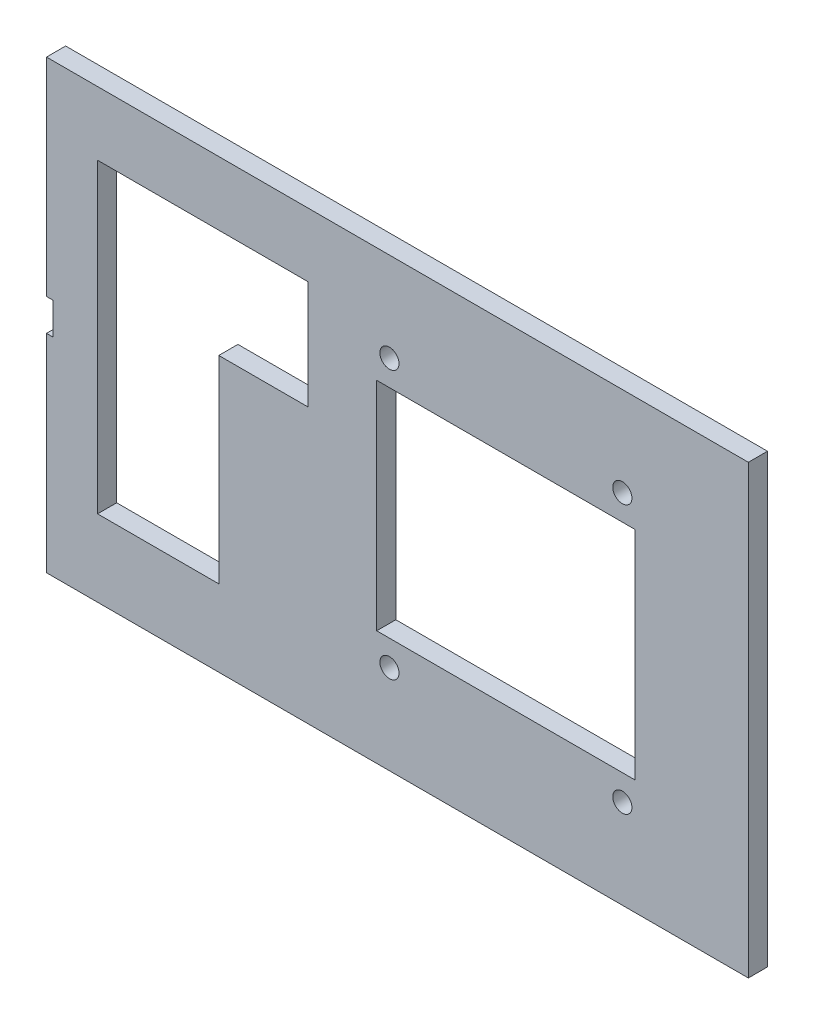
ISO-10303-21;
HEADER;
FILE_DESCRIPTION(('STEP AP214'),'2;1');
FILE_NAME('part.step','',(''),(''),'','','');
FILE_SCHEMA(('AUTOMOTIVE_DESIGN { 1 0 10303 214 1 1 1 1 }'));
ENDSEC;
DATA;
#1=APPLICATION_CONTEXT('core data for automotive mechanical design processes');
#2=APPLICATION_PROTOCOL_DEFINITION('international standard','automotive_design',2000,#1);
#3=PRODUCT_CONTEXT('',#1,'mechanical');
#4=PRODUCT('Part','Part','',(#3));
#5=PRODUCT_RELATED_PRODUCT_CATEGORY('part','',(#4));
#6=PRODUCT_DEFINITION_FORMATION('','',#4);
#7=PRODUCT_DEFINITION_CONTEXT('part definition',#1,'design');
#8=PRODUCT_DEFINITION('design','',#6,#7);
#9=PRODUCT_DEFINITION_SHAPE('','',#8);
#10=(LENGTH_UNIT() NAMED_UNIT(*) SI_UNIT(.MILLI.,.METRE.));
#11=(NAMED_UNIT(*) PLANE_ANGLE_UNIT() SI_UNIT($,.RADIAN.));
#12=(NAMED_UNIT(*) SI_UNIT($,.STERADIAN.) SOLID_ANGLE_UNIT());
#13=UNCERTAINTY_MEASURE_WITH_UNIT(LENGTH_MEASURE(1.E-05),#10,'distance_accuracy_value','');
#14=(GEOMETRIC_REPRESENTATION_CONTEXT(3) GLOBAL_UNCERTAINTY_ASSIGNED_CONTEXT((#13)) GLOBAL_UNIT_ASSIGNED_CONTEXT((#10,
#11,#12)) REPRESENTATION_CONTEXT('',''));
#15=CARTESIAN_POINT('',(0.,0.,0.));
#16=DIRECTION('',(0.,0.,1.));
#17=DIRECTION('',(1.,0.,0.));
#18=AXIS2_PLACEMENT_3D('',#15,#16,#17);
#19=CARTESIAN_POINT('',(0.,0.,3.));
#20=DIRECTION('',(0.,0.,1.));
#21=DIRECTION('',(1.,0.,0.));
#22=AXIS2_PLACEMENT_3D('',#19,#20,#21);
#23=PLANE('',#22);
#24=DIRECTION('',(0.,-1.,0.));
#25=VECTOR('',#24,1.);
#26=CARTESIAN_POINT('',(-47.,0.,3.));
#27=LINE('',#26,#25);
#28=CARTESIAN_POINT('',(-47.,25.,3.));
#29=VERTEX_POINT('',#28);
#30=CARTESIAN_POINT('',(-47.,-23.,3.));
#31=VERTEX_POINT('',#30);
#32=EDGE_CURVE('E187',#29,#31,#27,.T.);
#33=ORIENTED_EDGE('',*,*,#32,.F.);
#34=DIRECTION('',(-1.,0.,0.));
#35=VECTOR('',#34,1.);
#36=CARTESIAN_POINT('',(0.,25.,3.));
#37=LINE('',#36,#35);
#38=CARTESIAN_POINT('',(-14.,25.,3.));
#39=VERTEX_POINT('',#38);
#40=EDGE_CURVE('E185',#39,#29,#37,.T.);
#41=ORIENTED_EDGE('',*,*,#40,.F.);
#42=DIRECTION('',(0.,-1.,0.));
#43=VECTOR('',#42,1.);
#44=CARTESIAN_POINT('',(-14.,0.,3.));
#45=LINE('',#44,#43);
#46=CARTESIAN_POINT('',(-14.,7.99999999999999,3.));
#47=VERTEX_POINT('',#46);
#48=EDGE_CURVE('E180',#39,#47,#45,.T.);
#49=ORIENTED_EDGE('',*,*,#48,.T.);
#50=DIRECTION('',(-1.,0.,0.));
#51=VECTOR('',#50,1.);
#52=CARTESIAN_POINT('',(0.,7.99999999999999,3.));
#53=LINE('',#52,#51);
#54=CARTESIAN_POINT('',(-28.,7.99999999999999,3.));
#55=VERTEX_POINT('',#54);
#56=EDGE_CURVE('E178',#47,#55,#53,.T.);
#57=ORIENTED_EDGE('',*,*,#56,.T.);
#58=DIRECTION('',(0.,-1.,0.));
#59=VECTOR('',#58,1.);
#60=CARTESIAN_POINT('',(-28.,0.,3.));
#61=LINE('',#60,#59);
#62=CARTESIAN_POINT('',(-28.,-23.,3.));
#63=VERTEX_POINT('',#62);
#64=EDGE_CURVE('E163',#55,#63,#61,.T.);
#65=ORIENTED_EDGE('',*,*,#64,.T.);
#66=DIRECTION('',(-1.,0.,0.));
#67=VECTOR('',#66,1.);
#68=CARTESIAN_POINT('',(0.,-23.,3.));
#69=LINE('',#68,#67);
#70=EDGE_CURVE('E158',#63,#31,#69,.T.);
#71=ORIENTED_EDGE('',*,*,#70,.T.);
#72=EDGE_LOOP('',(#33,#41,#49,#57,#65,#71));
#73=FACE_BOUND('',#72,.T.);
#74=CARTESIAN_POINT('',(-1.25000000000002,21.,3.));
#75=DIRECTION('',(0.,0.,1.));
#76=DIRECTION('',(1.,0.,0.));
#77=AXIS2_PLACEMENT_3D('',#74,#75,#76);
#78=CIRCLE('',#77,1.5);
#79=CARTESIAN_POINT('',(0.249999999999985,21.,3.));
#80=VERTEX_POINT('',#79);
#81=EDGE_CURVE('E198',#80,#80,#78,.F.);
#82=ORIENTED_EDGE('',*,*,#81,.T.);
#83=EDGE_LOOP('',(#82));
#84=FACE_BOUND('',#83,.T.);
#85=CARTESIAN_POINT('',(35.25,-21.,3.));
#86=DIRECTION('',(0.,0.,1.));
#87=DIRECTION('',(1.,0.,0.));
#88=AXIS2_PLACEMENT_3D('',#85,#86,#87);
#89=CIRCLE('',#88,1.5);
#90=CARTESIAN_POINT('',(36.75,-21.,3.));
#91=VERTEX_POINT('',#90);
#92=EDGE_CURVE('E194',#91,#91,#89,.F.);
#93=ORIENTED_EDGE('',*,*,#92,.T.);
#94=EDGE_LOOP('',(#93));
#95=FACE_BOUND('',#94,.T.);
#96=CARTESIAN_POINT('',(-1.25000000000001,-21.,3.));
#97=DIRECTION('',(0.,0.,1.));
#98=DIRECTION('',(1.,0.,0.));
#99=AXIS2_PLACEMENT_3D('',#96,#97,#98);
#100=CIRCLE('',#99,1.5);
#101=CARTESIAN_POINT('',(0.249999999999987,-21.,3.));
#102=VERTEX_POINT('',#101);
#103=EDGE_CURVE('E190',#102,#102,#100,.F.);
#104=ORIENTED_EDGE('',*,*,#103,.T.);
#105=EDGE_LOOP('',(#104));
#106=FACE_BOUND('',#105,.T.);
#107=CARTESIAN_POINT('',(35.25,21.,3.));
#108=DIRECTION('',(0.,0.,1.));
#109=DIRECTION('',(1.,0.,0.));
#110=AXIS2_PLACEMENT_3D('',#107,#108,#109);
#111=CIRCLE('',#110,1.5);
#112=CARTESIAN_POINT('',(36.75,21.,3.));
#113=VERTEX_POINT('',#112);
#114=EDGE_CURVE('E202',#113,#113,#111,.F.);
#115=ORIENTED_EDGE('',*,*,#114,.T.);
#116=EDGE_LOOP('',(#115));
#117=FACE_BOUND('',#116,.T.);
#118=DIRECTION('',(0.,-1.,0.));
#119=VECTOR('',#118,1.);
#120=CARTESIAN_POINT('',(-55.,35.,3.));
#121=LINE('',#120,#119);
#122=CARTESIAN_POINT('',(-55.,35.,3.));
#123=VERTEX_POINT('',#122);
#124=CARTESIAN_POINT('',(-55.,2.5,3.));
#125=VERTEX_POINT('',#124);
#126=EDGE_CURVE('E254',#123,#125,#121,.T.);
#127=ORIENTED_EDGE('',*,*,#126,.T.);
#128=DIRECTION('',(1.,0.,0.));
#129=VECTOR('',#128,1.);
#130=CARTESIAN_POINT('',(0.,2.5,3.));
#131=LINE('',#130,#129);
#132=CARTESIAN_POINT('',(-54.,2.5,3.));
#133=VERTEX_POINT('',#132);
#134=EDGE_CURVE('E240',#125,#133,#131,.T.);
#135=ORIENTED_EDGE('',*,*,#134,.T.);
#136=DIRECTION('',(0.,-1.,0.));
#137=VECTOR('',#136,1.);
#138=CARTESIAN_POINT('',(-54.,0.,3.));
#139=LINE('',#138,#137);
#140=CARTESIAN_POINT('',(-54.,-2.5,3.));
#141=VERTEX_POINT('',#140);
#142=EDGE_CURVE('E243',#133,#141,#139,.T.);
#143=ORIENTED_EDGE('',*,*,#142,.T.);
#144=DIRECTION('',(-1.,0.,0.));
#145=VECTOR('',#144,1.);
#146=CARTESIAN_POINT('',(0.,-2.5,3.));
#147=LINE('',#146,#145);
#148=CARTESIAN_POINT('',(-55.,-2.5,3.));
#149=VERTEX_POINT('',#148);
#150=EDGE_CURVE('E235',#141,#149,#147,.T.);
#151=ORIENTED_EDGE('',*,*,#150,.T.);
#152=CARTESIAN_POINT('',(-55.,-35.,3.));
#153=VERTEX_POINT('',#152);
#154=EDGE_CURVE('E253',#149,#153,#121,.T.);
#155=ORIENTED_EDGE('',*,*,#154,.T.);
#156=DIRECTION('',(1.,0.,0.));
#157=VECTOR('',#156,1.);
#158=CARTESIAN_POINT('',(-55.,-35.,3.));
#159=LINE('',#158,#157);
#160=CARTESIAN_POINT('',(55.,-35.,3.));
#161=VERTEX_POINT('',#160);
#162=EDGE_CURVE('E257',#153,#161,#159,.T.);
#163=ORIENTED_EDGE('',*,*,#162,.T.);
#164=DIRECTION('',(0.,1.,0.));
#165=VECTOR('',#164,1.);
#166=CARTESIAN_POINT('',(55.,35.,3.));
#167=LINE('',#166,#165);
#168=CARTESIAN_POINT('',(55.,35.,3.));
#169=VERTEX_POINT('',#168);
#170=EDGE_CURVE('E247',#161,#169,#167,.T.);
#171=ORIENTED_EDGE('',*,*,#170,.T.);
#172=DIRECTION('',(-1.,0.,0.));
#173=VECTOR('',#172,1.);
#174=CARTESIAN_POINT('',(-55.,35.,3.));
#175=LINE('',#174,#173);
#176=EDGE_CURVE('E250',#169,#123,#175,.T.);
#177=ORIENTED_EDGE('',*,*,#176,.T.);
#178=EDGE_LOOP('',(#127,#135,#143,#151,#155,#163,#171,#177));
#179=FACE_BOUND('',#178,.T.);
#180=DIRECTION('',(1.,0.,0.));
#181=VECTOR('',#180,1.);
#182=CARTESIAN_POINT('',(0.,17.,3.));
#183=LINE('',#182,#181);
#184=CARTESIAN_POINT('',(-3.25000000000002,17.,3.));
#185=VERTEX_POINT('',#184);
#186=CARTESIAN_POINT('',(37.25,17.,3.));
#187=VERTEX_POINT('',#186);
#188=EDGE_CURVE('E222',#185,#187,#183,.T.);
#189=ORIENTED_EDGE('',*,*,#188,.T.);
#190=DIRECTION('',(0.,-1.,0.));
#191=VECTOR('',#190,1.);
#192=CARTESIAN_POINT('',(37.25,0.,3.));
#193=LINE('',#192,#191);
#194=CARTESIAN_POINT('',(37.25,-17.,3.));
#195=VERTEX_POINT('',#194);
#196=EDGE_CURVE('E225',#187,#195,#193,.T.);
#197=ORIENTED_EDGE('',*,*,#196,.T.);
#198=DIRECTION('',(-1.,0.,0.));
#199=VECTOR('',#198,1.);
#200=CARTESIAN_POINT('',(0.,-17.,3.));
#201=LINE('',#200,#199);
#202=CARTESIAN_POINT('',(-3.25000000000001,-17.,3.));
#203=VERTEX_POINT('',#202);
#204=EDGE_CURVE('E216',#195,#203,#201,.T.);
#205=ORIENTED_EDGE('',*,*,#204,.T.);
#206=DIRECTION('',(0.,1.,0.));
#207=VECTOR('',#206,1.);
#208=CARTESIAN_POINT('',(-3.25000000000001,0.,3.));
#209=LINE('',#208,#207);
#210=EDGE_CURVE('E219',#203,#185,#209,.T.);
#211=ORIENTED_EDGE('',*,*,#210,.T.);
#212=EDGE_LOOP('',(#189,#197,#205,#211));
#213=FACE_BOUND('',#212,.T.);
#214=ADVANCED_FACE('F36',(#73,#84,#95,#106,#117,#179,#213),#23,.T.);
#215=CARTESIAN_POINT('',(0.,0.,0.));
#216=DIRECTION('',(0.,0.,1.));
#217=DIRECTION('',(1.,0.,0.));
#218=AXIS2_PLACEMENT_3D('',#215,#216,#217);
#219=PLANE('',#218);
#220=DIRECTION('',(-1.,0.,0.));
#221=VECTOR('',#220,1.);
#222=CARTESIAN_POINT('',(0.,25.,0.));
#223=LINE('',#222,#221);
#224=CARTESIAN_POINT('',(-14.,25.,0.));
#225=VERTEX_POINT('',#224);
#226=CARTESIAN_POINT('',(-47.,25.,0.));
#227=VERTEX_POINT('',#226);
#228=EDGE_CURVE('E44',#225,#227,#223,.T.);
#229=ORIENTED_EDGE('',*,*,#228,.T.);
#230=DIRECTION('',(0.,-1.,0.));
#231=VECTOR('',#230,1.);
#232=CARTESIAN_POINT('',(-47.,0.,0.));
#233=LINE('',#232,#231);
#234=CARTESIAN_POINT('',(-47.,-23.,0.));
#235=VERTEX_POINT('',#234);
#236=EDGE_CURVE('E11',#227,#235,#233,.T.);
#237=ORIENTED_EDGE('',*,*,#236,.T.);
#238=DIRECTION('',(-1.,0.,0.));
#239=VECTOR('',#238,1.);
#240=CARTESIAN_POINT('',(0.,-23.,0.));
#241=LINE('',#240,#239);
#242=CARTESIAN_POINT('',(-28.,-23.,0.));
#243=VERTEX_POINT('',#242);
#244=EDGE_CURVE('E296',#243,#235,#241,.T.);
#245=ORIENTED_EDGE('',*,*,#244,.F.);
#246=DIRECTION('',(0.,-1.,0.));
#247=VECTOR('',#246,1.);
#248=CARTESIAN_POINT('',(-28.,0.,0.));
#249=LINE('',#248,#247);
#250=CARTESIAN_POINT('',(-28.,7.99999999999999,0.));
#251=VERTEX_POINT('',#250);
#252=EDGE_CURVE('E171',#251,#243,#249,.T.);
#253=ORIENTED_EDGE('',*,*,#252,.F.);
#254=DIRECTION('',(-1.,0.,0.));
#255=VECTOR('',#254,1.);
#256=CARTESIAN_POINT('',(0.,7.99999999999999,0.));
#257=LINE('',#256,#255);
#258=CARTESIAN_POINT('',(-14.,7.99999999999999,0.));
#259=VERTEX_POINT('',#258);
#260=EDGE_CURVE('E307',#259,#251,#257,.T.);
#261=ORIENTED_EDGE('',*,*,#260,.F.);
#262=DIRECTION('',(0.,-1.,0.));
#263=VECTOR('',#262,1.);
#264=CARTESIAN_POINT('',(-14.,0.,0.));
#265=LINE('',#264,#263);
#266=EDGE_CURVE('E309',#225,#259,#265,.T.);
#267=ORIENTED_EDGE('',*,*,#266,.F.);
#268=EDGE_LOOP('',(#229,#237,#245,#253,#261,#267));
#269=FACE_BOUND('',#268,.T.);
#270=CARTESIAN_POINT('',(-1.25000000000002,21.,0.));
#271=DIRECTION('',(0.,0.,1.));
#272=DIRECTION('',(1.,0.,0.));
#273=AXIS2_PLACEMENT_3D('',#270,#271,#272);
#274=CIRCLE('',#273,1.5);
#275=CARTESIAN_POINT('',(0.249999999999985,21.,0.));
#276=VERTEX_POINT('',#275);
#277=EDGE_CURVE('E197',#276,#276,#274,.F.);
#278=ORIENTED_EDGE('',*,*,#277,.F.);
#279=EDGE_LOOP('',(#278));
#280=FACE_BOUND('',#279,.T.);
#281=CARTESIAN_POINT('',(35.25,-21.,0.));
#282=DIRECTION('',(0.,0.,1.));
#283=DIRECTION('',(1.,0.,0.));
#284=AXIS2_PLACEMENT_3D('',#281,#282,#283);
#285=CIRCLE('',#284,1.5);
#286=CARTESIAN_POINT('',(36.75,-21.,0.));
#287=VERTEX_POINT('',#286);
#288=EDGE_CURVE('E193',#287,#287,#285,.F.);
#289=ORIENTED_EDGE('',*,*,#288,.F.);
#290=EDGE_LOOP('',(#289));
#291=FACE_BOUND('',#290,.T.);
#292=CARTESIAN_POINT('',(-1.25000000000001,-21.,0.));
#293=DIRECTION('',(0.,0.,1.));
#294=DIRECTION('',(1.,0.,0.));
#295=AXIS2_PLACEMENT_3D('',#292,#293,#294);
#296=CIRCLE('',#295,1.5);
#297=CARTESIAN_POINT('',(0.249999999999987,-21.,0.));
#298=VERTEX_POINT('',#297);
#299=EDGE_CURVE('E189',#298,#298,#296,.F.);
#300=ORIENTED_EDGE('',*,*,#299,.F.);
#301=EDGE_LOOP('',(#300));
#302=FACE_BOUND('',#301,.T.);
#303=CARTESIAN_POINT('',(35.25,21.,0.));
#304=DIRECTION('',(0.,0.,1.));
#305=DIRECTION('',(1.,0.,0.));
#306=AXIS2_PLACEMENT_3D('',#303,#304,#305);
#307=CIRCLE('',#306,1.5);
#308=CARTESIAN_POINT('',(36.75,21.,0.));
#309=VERTEX_POINT('',#308);
#310=EDGE_CURVE('E201',#309,#309,#307,.F.);
#311=ORIENTED_EDGE('',*,*,#310,.F.);
#312=EDGE_LOOP('',(#311));
#313=FACE_BOUND('',#312,.T.);
#314=DIRECTION('',(1.,0.,0.));
#315=VECTOR('',#314,1.);
#316=CARTESIAN_POINT('',(0.,2.5,0.));
#317=LINE('',#316,#315);
#318=CARTESIAN_POINT('',(-55.,2.5,0.));
#319=VERTEX_POINT('',#318);
#320=CARTESIAN_POINT('',(-54.,2.5,0.));
#321=VERTEX_POINT('',#320);
#322=EDGE_CURVE('E285',#319,#321,#317,.T.);
#323=ORIENTED_EDGE('',*,*,#322,.F.);
#324=DIRECTION('',(0.,-1.,0.));
#325=VECTOR('',#324,1.);
#326=CARTESIAN_POINT('',(-55.,35.,0.));
#327=LINE('',#326,#325);
#328=CARTESIAN_POINT('',(-55.,35.,0.));
#329=VERTEX_POINT('',#328);
#330=EDGE_CURVE('E265',#329,#319,#327,.T.);
#331=ORIENTED_EDGE('',*,*,#330,.F.);
#332=DIRECTION('',(-1.,0.,0.));
#333=VECTOR('',#332,1.);
#334=CARTESIAN_POINT('',(-55.,35.,0.));
#335=LINE('',#334,#333);
#336=CARTESIAN_POINT('',(55.,35.,0.));
#337=VERTEX_POINT('',#336);
#338=EDGE_CURVE('E262',#337,#329,#335,.T.);
#339=ORIENTED_EDGE('',*,*,#338,.F.);
#340=DIRECTION('',(0.,1.,0.));
#341=VECTOR('',#340,1.);
#342=CARTESIAN_POINT('',(55.,35.,0.));
#343=LINE('',#342,#341);
#344=CARTESIAN_POINT('',(55.,-35.,0.));
#345=VERTEX_POINT('',#344);
#346=EDGE_CURVE('E246',#345,#337,#343,.T.);
#347=ORIENTED_EDGE('',*,*,#346,.F.);
#348=DIRECTION('',(1.,0.,0.));
#349=VECTOR('',#348,1.);
#350=CARTESIAN_POINT('',(-55.,-35.,0.));
#351=LINE('',#350,#349);
#352=CARTESIAN_POINT('',(-55.,-35.,0.));
#353=VERTEX_POINT('',#352);
#354=EDGE_CURVE('E251',#353,#345,#351,.T.);
#355=ORIENTED_EDGE('',*,*,#354,.F.);
#356=CARTESIAN_POINT('',(-55.,-2.5,0.));
#357=VERTEX_POINT('',#356);
#358=EDGE_CURVE('E264',#357,#353,#327,.T.);
#359=ORIENTED_EDGE('',*,*,#358,.F.);
#360=DIRECTION('',(-1.,0.,0.));
#361=VECTOR('',#360,1.);
#362=CARTESIAN_POINT('',(0.,-2.5,0.));
#363=LINE('',#362,#361);
#364=CARTESIAN_POINT('',(-54.,-2.5,0.));
#365=VERTEX_POINT('',#364);
#366=EDGE_CURVE('E280',#365,#357,#363,.T.);
#367=ORIENTED_EDGE('',*,*,#366,.F.);
#368=DIRECTION('',(0.,-1.,0.));
#369=VECTOR('',#368,1.);
#370=CARTESIAN_POINT('',(-54.,0.,0.));
#371=LINE('',#370,#369);
#372=EDGE_CURVE('E282',#321,#365,#371,.T.);
#373=ORIENTED_EDGE('',*,*,#372,.F.);
#374=EDGE_LOOP('',(#323,#331,#339,#347,#355,#359,#367,#373));
#375=FACE_BOUND('',#374,.T.);
#376=DIRECTION('',(0.,-1.,0.));
#377=VECTOR('',#376,1.);
#378=CARTESIAN_POINT('',(37.25,0.,0.));
#379=LINE('',#378,#377);
#380=CARTESIAN_POINT('',(37.25,17.,0.));
#381=VERTEX_POINT('',#380);
#382=CARTESIAN_POINT('',(37.25,-17.,0.));
#383=VERTEX_POINT('',#382);
#384=EDGE_CURVE('E293',#381,#383,#379,.T.);
#385=ORIENTED_EDGE('',*,*,#384,.F.);
#386=DIRECTION('',(1.,0.,0.));
#387=VECTOR('',#386,1.);
#388=CARTESIAN_POINT('',(0.,17.,0.));
#389=LINE('',#388,#387);
#390=CARTESIAN_POINT('',(-3.25000000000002,17.,0.));
#391=VERTEX_POINT('',#390);
#392=EDGE_CURVE('E291',#391,#381,#389,.T.);
#393=ORIENTED_EDGE('',*,*,#392,.F.);
#394=DIRECTION('',(0.,1.,0.));
#395=VECTOR('',#394,1.);
#396=CARTESIAN_POINT('',(-3.25000000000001,0.,0.));
#397=LINE('',#396,#395);
#398=CARTESIAN_POINT('',(-3.25000000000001,-17.,0.));
#399=VERTEX_POINT('',#398);
#400=EDGE_CURVE('E289',#399,#391,#397,.T.);
#401=ORIENTED_EDGE('',*,*,#400,.F.);
#402=DIRECTION('',(-1.,0.,0.));
#403=VECTOR('',#402,1.);
#404=CARTESIAN_POINT('',(0.,-17.,0.));
#405=LINE('',#404,#403);
#406=EDGE_CURVE('E287',#383,#399,#405,.T.);
#407=ORIENTED_EDGE('',*,*,#406,.F.);
#408=EDGE_LOOP('',(#385,#393,#401,#407));
#409=FACE_BOUND('',#408,.T.);
#410=ADVANCED_FACE('F313',(#269,#280,#291,#302,#313,#375,#409),#219,.F.);
#411=CARTESIAN_POINT('',(-55.,35.,3.));
#412=DIRECTION('',(1.,0.,0.));
#413=DIRECTION('',(0.,0.,-1.));
#414=AXIS2_PLACEMENT_3D('',#411,#412,#413);
#415=PLANE('',#414);
#416=DIRECTION('',(0.,0.,-1.));
#417=VECTOR('',#416,1.);
#418=CARTESIAN_POINT('',(-55.,2.5,3.));
#419=LINE('',#418,#417);
#420=EDGE_CURVE('E238',#125,#319,#419,.T.);
#421=ORIENTED_EDGE('',*,*,#420,.F.);
#422=ORIENTED_EDGE('',*,*,#126,.F.);
#423=DIRECTION('',(0.,0.,-1.));
#424=VECTOR('',#423,1.);
#425=CARTESIAN_POINT('',(-55.,35.,3.));
#426=LINE('',#425,#424);
#427=EDGE_CURVE('E274',#123,#329,#426,.T.);
#428=ORIENTED_EDGE('',*,*,#427,.T.);
#429=ORIENTED_EDGE('',*,*,#330,.T.);
#430=EDGE_LOOP('',(#421,#422,#428,#429));
#431=FACE_BOUND('',#430,.T.);
#432=ADVANCED_FACE('F353',(#431),#415,.F.);
#433=DIRECTION('',(0.,0.,1.));
#434=VECTOR('',#433,1.);
#435=CARTESIAN_POINT('',(-55.,-2.5,3.));
#436=LINE('',#435,#434);
#437=EDGE_CURVE('E233',#357,#149,#436,.T.);
#438=ORIENTED_EDGE('',*,*,#437,.F.);
#439=ORIENTED_EDGE('',*,*,#358,.T.);
#440=DIRECTION('',(0.,0.,-1.));
#441=VECTOR('',#440,1.);
#442=CARTESIAN_POINT('',(-55.,-35.,3.));
#443=LINE('',#442,#441);
#444=EDGE_CURVE('E271',#153,#353,#443,.T.);
#445=ORIENTED_EDGE('',*,*,#444,.F.);
#446=ORIENTED_EDGE('',*,*,#154,.F.);
#447=EDGE_LOOP('',(#438,#439,#445,#446));
#448=FACE_BOUND('',#447,.T.);
#449=ADVANCED_FACE('F365',(#448),#415,.F.);
#450=CARTESIAN_POINT('',(55.,35.,3.));
#451=DIRECTION('',(-1.,0.,0.));
#452=DIRECTION('',(0.,0.,1.));
#453=AXIS2_PLACEMENT_3D('',#450,#451,#452);
#454=PLANE('',#453);
#455=ORIENTED_EDGE('',*,*,#346,.T.);
#456=DIRECTION('',(0.,0.,-1.));
#457=VECTOR('',#456,1.);
#458=CARTESIAN_POINT('',(55.,35.,3.));
#459=LINE('',#458,#457);
#460=EDGE_CURVE('E277',#169,#337,#459,.T.);
#461=ORIENTED_EDGE('',*,*,#460,.F.);
#462=ORIENTED_EDGE('',*,*,#170,.F.);
#463=DIRECTION('',(0.,0.,-1.));
#464=VECTOR('',#463,1.);
#465=CARTESIAN_POINT('',(55.,-35.,3.));
#466=LINE('',#465,#464);
#467=EDGE_CURVE('E259',#161,#345,#466,.T.);
#468=ORIENTED_EDGE('',*,*,#467,.T.);
#469=EDGE_LOOP('',(#455,#461,#462,#468));
#470=FACE_BOUND('',#469,.T.);
#471=ADVANCED_FACE('F38',(#470),#454,.F.);
#472=CARTESIAN_POINT('',(-55.,35.,3.));
#473=DIRECTION('',(0.,-1.,0.));
#474=DIRECTION('',(0.,0.,-1.));
#475=AXIS2_PLACEMENT_3D('',#472,#473,#474);
#476=PLANE('',#475);
#477=ORIENTED_EDGE('',*,*,#338,.T.);
#478=ORIENTED_EDGE('',*,*,#427,.F.);
#479=ORIENTED_EDGE('',*,*,#176,.F.);
#480=ORIENTED_EDGE('',*,*,#460,.T.);
#481=EDGE_LOOP('',(#477,#478,#479,#480));
#482=FACE_BOUND('',#481,.T.);
#483=ADVANCED_FACE('F362',(#482),#476,.F.);
#484=CARTESIAN_POINT('',(-55.,-35.,3.));
#485=DIRECTION('',(0.,1.,0.));
#486=DIRECTION('',(0.,0.,1.));
#487=AXIS2_PLACEMENT_3D('',#484,#485,#486);
#488=PLANE('',#487);
#489=ORIENTED_EDGE('',*,*,#354,.T.);
#490=ORIENTED_EDGE('',*,*,#467,.F.);
#491=ORIENTED_EDGE('',*,*,#162,.F.);
#492=ORIENTED_EDGE('',*,*,#444,.T.);
#493=EDGE_LOOP('',(#489,#490,#491,#492));
#494=FACE_BOUND('',#493,.T.);
#495=ADVANCED_FACE('F359',(#494),#488,.F.);
#496=CARTESIAN_POINT('',(-54.,2.5,18.));
#497=DIRECTION('',(-1.,0.,0.));
#498=DIRECTION('',(0.,0.,1.));
#499=AXIS2_PLACEMENT_3D('',#496,#497,#498);
#500=PLANE('',#499);
#501=DIRECTION('',(0.,0.,-1.));
#502=VECTOR('',#501,1.);
#503=CARTESIAN_POINT('',(-54.,2.5,18.));
#504=LINE('',#503,#502);
#505=EDGE_CURVE('E230',#133,#321,#504,.T.);
#506=ORIENTED_EDGE('',*,*,#505,.T.);
#507=ORIENTED_EDGE('',*,*,#372,.T.);
#508=DIRECTION('',(0.,0.,-1.));
#509=VECTOR('',#508,1.);
#510=CARTESIAN_POINT('',(-54.,-2.5,18.));
#511=LINE('',#510,#509);
#512=EDGE_CURVE('E228',#141,#365,#511,.T.);
#513=ORIENTED_EDGE('',*,*,#512,.F.);
#514=ORIENTED_EDGE('',*,*,#142,.F.);
#515=EDGE_LOOP('',(#506,#507,#513,#514));
#516=FACE_BOUND('',#515,.T.);
#517=ADVANCED_FACE('F356',(#516),#500,.T.);
#518=CARTESIAN_POINT('',(-56.,2.5,18.));
#519=DIRECTION('',(0.,-1.,0.));
#520=DIRECTION('',(0.,0.,-1.));
#521=AXIS2_PLACEMENT_3D('',#518,#519,#520);
#522=PLANE('',#521);
#523=ORIENTED_EDGE('',*,*,#420,.T.);
#524=ORIENTED_EDGE('',*,*,#322,.T.);
#525=ORIENTED_EDGE('',*,*,#505,.F.);
#526=ORIENTED_EDGE('',*,*,#134,.F.);
#527=EDGE_LOOP('',(#523,#524,#525,#526));
#528=FACE_BOUND('',#527,.T.);
#529=ADVANCED_FACE('F386',(#528),#522,.T.);
#530=CARTESIAN_POINT('',(-56.,-2.5,18.));
#531=DIRECTION('',(0.,1.,0.));
#532=DIRECTION('',(0.,0.,1.));
#533=AXIS2_PLACEMENT_3D('',#530,#531,#532);
#534=PLANE('',#533);
#535=ORIENTED_EDGE('',*,*,#512,.T.);
#536=ORIENTED_EDGE('',*,*,#366,.T.);
#537=ORIENTED_EDGE('',*,*,#437,.T.);
#538=ORIENTED_EDGE('',*,*,#150,.F.);
#539=EDGE_LOOP('',(#535,#536,#537,#538));
#540=FACE_BOUND('',#539,.T.);
#541=ADVANCED_FACE('F401',(#540),#534,.T.);
#542=CARTESIAN_POINT('',(37.25,17.,13.));
#543=DIRECTION('',(-1.,0.,0.));
#544=DIRECTION('',(0.,0.,1.));
#545=AXIS2_PLACEMENT_3D('',#542,#543,#544);
#546=PLANE('',#545);
#547=DIRECTION('',(0.,0.,-1.));
#548=VECTOR('',#547,1.);
#549=CARTESIAN_POINT('',(37.25,17.,13.));
#550=LINE('',#549,#548);
#551=EDGE_CURVE('E213',#187,#381,#550,.T.);
#552=ORIENTED_EDGE('',*,*,#551,.T.);
#553=ORIENTED_EDGE('',*,*,#384,.T.);
#554=DIRECTION('',(0.,0.,-1.));
#555=VECTOR('',#554,1.);
#556=CARTESIAN_POINT('',(37.25,-17.,13.));
#557=LINE('',#556,#555);
#558=EDGE_CURVE('E205',#195,#383,#557,.T.);
#559=ORIENTED_EDGE('',*,*,#558,.F.);
#560=ORIENTED_EDGE('',*,*,#196,.F.);
#561=EDGE_LOOP('',(#552,#553,#559,#560));
#562=FACE_BOUND('',#561,.T.);
#563=ADVANCED_FACE('F403',(#562),#546,.T.);
#564=CARTESIAN_POINT('',(-3.25000000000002,17.,13.));
#565=DIRECTION('',(0.,-1.,0.));
#566=DIRECTION('',(0.,0.,-1.));
#567=AXIS2_PLACEMENT_3D('',#564,#565,#566);
#568=PLANE('',#567);
#569=DIRECTION('',(0.,0.,-1.));
#570=VECTOR('',#569,1.);
#571=CARTESIAN_POINT('',(-3.25000000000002,17.,13.));
#572=LINE('',#571,#570);
#573=EDGE_CURVE('E210',#185,#391,#572,.T.);
#574=ORIENTED_EDGE('',*,*,#573,.T.);
#575=ORIENTED_EDGE('',*,*,#392,.T.);
#576=ORIENTED_EDGE('',*,*,#551,.F.);
#577=ORIENTED_EDGE('',*,*,#188,.F.);
#578=EDGE_LOOP('',(#574,#575,#576,#577));
#579=FACE_BOUND('',#578,.T.);
#580=ADVANCED_FACE('F409',(#579),#568,.T.);
#581=CARTESIAN_POINT('',(-3.25000000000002,17.,13.));
#582=DIRECTION('',(1.,0.,0.));
#583=DIRECTION('',(0.,1.,0.));
#584=AXIS2_PLACEMENT_3D('',#581,#582,#583);
#585=PLANE('',#584);
#586=DIRECTION('',(0.,0.,-1.));
#587=VECTOR('',#586,1.);
#588=CARTESIAN_POINT('',(-3.25000000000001,-17.,13.));
#589=LINE('',#588,#587);
#590=EDGE_CURVE('E207',#203,#399,#589,.T.);
#591=ORIENTED_EDGE('',*,*,#590,.T.);
#592=ORIENTED_EDGE('',*,*,#400,.T.);
#593=ORIENTED_EDGE('',*,*,#573,.F.);
#594=ORIENTED_EDGE('',*,*,#210,.F.);
#595=EDGE_LOOP('',(#591,#592,#593,#594));
#596=FACE_BOUND('',#595,.T.);
#597=ADVANCED_FACE('F415',(#596),#585,.T.);
#598=CARTESIAN_POINT('',(-3.25000000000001,-17.,13.));
#599=DIRECTION('',(0.,1.,0.));
#600=DIRECTION('',(0.,0.,1.));
#601=AXIS2_PLACEMENT_3D('',#598,#599,#600);
#602=PLANE('',#601);
#603=ORIENTED_EDGE('',*,*,#558,.T.);
#604=ORIENTED_EDGE('',*,*,#406,.T.);
#605=ORIENTED_EDGE('',*,*,#590,.F.);
#606=ORIENTED_EDGE('',*,*,#204,.F.);
#607=EDGE_LOOP('',(#603,#604,#605,#606));
#608=FACE_BOUND('',#607,.T.);
#609=ADVANCED_FACE('F419',(#608),#602,.T.);
#610=CARTESIAN_POINT('',(35.25,21.,-10.));
#611=DIRECTION('',(0.,0.,1.));
#612=DIRECTION('',(1.,0.,0.));
#613=AXIS2_PLACEMENT_3D('',#610,#611,#612);
#614=CYLINDRICAL_SURFACE('',#613,1.5);
#615=ORIENTED_EDGE('',*,*,#114,.F.);
#616=EDGE_LOOP('',(#615));
#617=FACE_BOUND('',#616,.T.);
#618=ORIENTED_EDGE('',*,*,#310,.T.);
#619=EDGE_LOOP('',(#618));
#620=FACE_BOUND('',#619,.T.);
#621=ADVANCED_FACE('F423',(#617,#620),#614,.F.);
#622=CARTESIAN_POINT('',(-1.25000000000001,-21.,-10.));
#623=DIRECTION('',(0.,0.,1.));
#624=DIRECTION('',(1.,0.,0.));
#625=AXIS2_PLACEMENT_3D('',#622,#623,#624);
#626=CYLINDRICAL_SURFACE('',#625,1.5);
#627=ORIENTED_EDGE('',*,*,#103,.F.);
#628=EDGE_LOOP('',(#627));
#629=FACE_BOUND('',#628,.T.);
#630=ORIENTED_EDGE('',*,*,#299,.T.);
#631=EDGE_LOOP('',(#630));
#632=FACE_BOUND('',#631,.T.);
#633=ADVANCED_FACE('F427',(#629,#632),#626,.F.);
#634=CARTESIAN_POINT('',(35.25,-21.,-10.));
#635=DIRECTION('',(0.,0.,1.));
#636=DIRECTION('',(1.,0.,0.));
#637=AXIS2_PLACEMENT_3D('',#634,#635,#636);
#638=CYLINDRICAL_SURFACE('',#637,1.5);
#639=ORIENTED_EDGE('',*,*,#92,.F.);
#640=EDGE_LOOP('',(#639));
#641=FACE_BOUND('',#640,.T.);
#642=ORIENTED_EDGE('',*,*,#288,.T.);
#643=EDGE_LOOP('',(#642));
#644=FACE_BOUND('',#643,.T.);
#645=ADVANCED_FACE('F345',(#641,#644),#638,.F.);
#646=CARTESIAN_POINT('',(-1.25000000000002,21.,-10.));
#647=DIRECTION('',(0.,0.,1.));
#648=DIRECTION('',(1.,0.,0.));
#649=AXIS2_PLACEMENT_3D('',#646,#647,#648);
#650=CYLINDRICAL_SURFACE('',#649,1.5);
#651=ORIENTED_EDGE('',*,*,#81,.F.);
#652=EDGE_LOOP('',(#651));
#653=FACE_BOUND('',#652,.T.);
#654=ORIENTED_EDGE('',*,*,#277,.T.);
#655=EDGE_LOOP('',(#654));
#656=FACE_BOUND('',#655,.T.);
#657=ADVANCED_FACE('F338',(#653,#656),#650,.F.);
#658=CARTESIAN_POINT('',(-47.,0.,-10.));
#659=DIRECTION('',(-1.,0.,0.));
#660=DIRECTION('',(0.,-1.,0.));
#661=AXIS2_PLACEMENT_3D('',#658,#659,#660);
#662=PLANE('',#661);
#663=ORIENTED_EDGE('',*,*,#32,.T.);
#664=DIRECTION('',(0.,0.,1.));
#665=VECTOR('',#664,1.);
#666=CARTESIAN_POINT('',(-47.,-23.,-10.));
#667=LINE('',#666,#665);
#668=EDGE_CURVE('E51',#235,#31,#667,.T.);
#669=ORIENTED_EDGE('',*,*,#668,.F.);
#670=ORIENTED_EDGE('',*,*,#236,.F.);
#671=DIRECTION('',(0.,0.,1.));
#672=VECTOR('',#671,1.);
#673=CARTESIAN_POINT('',(-47.,25.,-10.));
#674=LINE('',#673,#672);
#675=EDGE_CURVE('E164',#227,#29,#674,.T.);
#676=ORIENTED_EDGE('',*,*,#675,.T.);
#677=EDGE_LOOP('',(#663,#669,#670,#676));
#678=FACE_BOUND('',#677,.T.);
#679=ADVANCED_FACE('F336',(#678),#662,.F.);
#680=CARTESIAN_POINT('',(0.,25.,-10.));
#681=DIRECTION('',(0.,1.,0.));
#682=DIRECTION('',(0.,0.,1.));
#683=AXIS2_PLACEMENT_3D('',#680,#681,#682);
#684=PLANE('',#683);
#685=ORIENTED_EDGE('',*,*,#40,.T.);
#686=ORIENTED_EDGE('',*,*,#675,.F.);
#687=ORIENTED_EDGE('',*,*,#228,.F.);
#688=DIRECTION('',(0.,0.,1.));
#689=VECTOR('',#688,1.);
#690=CARTESIAN_POINT('',(-14.,25.,-10.));
#691=LINE('',#690,#689);
#692=EDGE_CURVE('E321',#225,#39,#691,.T.);
#693=ORIENTED_EDGE('',*,*,#692,.T.);
#694=EDGE_LOOP('',(#685,#686,#687,#693));
#695=FACE_BOUND('',#694,.T.);
#696=ADVANCED_FACE('F320',(#695),#684,.F.);
#697=CARTESIAN_POINT('',(-14.,0.,-10.));
#698=DIRECTION('',(-1.,0.,0.));
#699=DIRECTION('',(0.,-1.,0.));
#700=AXIS2_PLACEMENT_3D('',#697,#698,#699);
#701=PLANE('',#700);
#702=ORIENTED_EDGE('',*,*,#692,.F.);
#703=ORIENTED_EDGE('',*,*,#266,.T.);
#704=DIRECTION('',(0.,0.,1.));
#705=VECTOR('',#704,1.);
#706=CARTESIAN_POINT('',(-14.,7.99999999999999,-10.));
#707=LINE('',#706,#705);
#708=EDGE_CURVE('E328',#259,#47,#707,.T.);
#709=ORIENTED_EDGE('',*,*,#708,.T.);
#710=ORIENTED_EDGE('',*,*,#48,.F.);
#711=EDGE_LOOP('',(#702,#703,#709,#710));
#712=FACE_BOUND('',#711,.T.);
#713=ADVANCED_FACE('F325',(#712),#701,.T.);
#714=CARTESIAN_POINT('',(0.,7.99999999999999,-10.));
#715=DIRECTION('',(0.,1.,0.));
#716=DIRECTION('',(0.,0.,1.));
#717=AXIS2_PLACEMENT_3D('',#714,#715,#716);
#718=PLANE('',#717);
#719=ORIENTED_EDGE('',*,*,#708,.F.);
#720=ORIENTED_EDGE('',*,*,#260,.T.);
#721=DIRECTION('',(0.,0.,1.));
#722=VECTOR('',#721,1.);
#723=CARTESIAN_POINT('',(-28.,7.99999999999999,-10.));
#724=LINE('',#723,#722);
#725=EDGE_CURVE('E173',#251,#55,#724,.T.);
#726=ORIENTED_EDGE('',*,*,#725,.T.);
#727=ORIENTED_EDGE('',*,*,#56,.F.);
#728=EDGE_LOOP('',(#719,#720,#726,#727));
#729=FACE_BOUND('',#728,.T.);
#730=ADVANCED_FACE('F334',(#729),#718,.T.);
#731=CARTESIAN_POINT('',(-28.,0.,-10.));
#732=DIRECTION('',(-1.,0.,0.));
#733=DIRECTION('',(0.,-1.,0.));
#734=AXIS2_PLACEMENT_3D('',#731,#732,#733);
#735=PLANE('',#734);
#736=ORIENTED_EDGE('',*,*,#725,.F.);
#737=ORIENTED_EDGE('',*,*,#252,.T.);
#738=DIRECTION('',(0.,0.,1.));
#739=VECTOR('',#738,1.);
#740=CARTESIAN_POINT('',(-28.,-23.,-10.));
#741=LINE('',#740,#739);
#742=EDGE_CURVE('E56',#243,#63,#741,.T.);
#743=ORIENTED_EDGE('',*,*,#742,.T.);
#744=ORIENTED_EDGE('',*,*,#64,.F.);
#745=EDGE_LOOP('',(#736,#737,#743,#744));
#746=FACE_BOUND('',#745,.T.);
#747=ADVANCED_FACE('F168',(#746),#735,.T.);
#748=CARTESIAN_POINT('',(0.,-23.,-10.));
#749=DIRECTION('',(0.,1.,0.));
#750=DIRECTION('',(0.,0.,1.));
#751=AXIS2_PLACEMENT_3D('',#748,#749,#750);
#752=PLANE('',#751);
#753=ORIENTED_EDGE('',*,*,#742,.F.);
#754=ORIENTED_EDGE('',*,*,#244,.T.);
#755=ORIENTED_EDGE('',*,*,#668,.T.);
#756=ORIENTED_EDGE('',*,*,#70,.F.);
#757=EDGE_LOOP('',(#753,#754,#755,#756));
#758=FACE_BOUND('',#757,.T.);
#759=ADVANCED_FACE('F159',(#758),#752,.T.);
#760=CLOSED_SHELL('',(#214,#410,#432,#449,#471,#483,#495,#517,#529,#541,#563,#580,#597,#609,
#621,#633,#645,#657,#679,#696,#713,#730,#747,#759));
#761=MANIFOLD_SOLID_BREP('B2',#760);
#762=ADVANCED_BREP_SHAPE_REPRESENTATION('',(#18,#761),#14);
#763=SHAPE_DEFINITION_REPRESENTATION(#9,#762);
ENDSEC;
END-ISO-10303-21;
